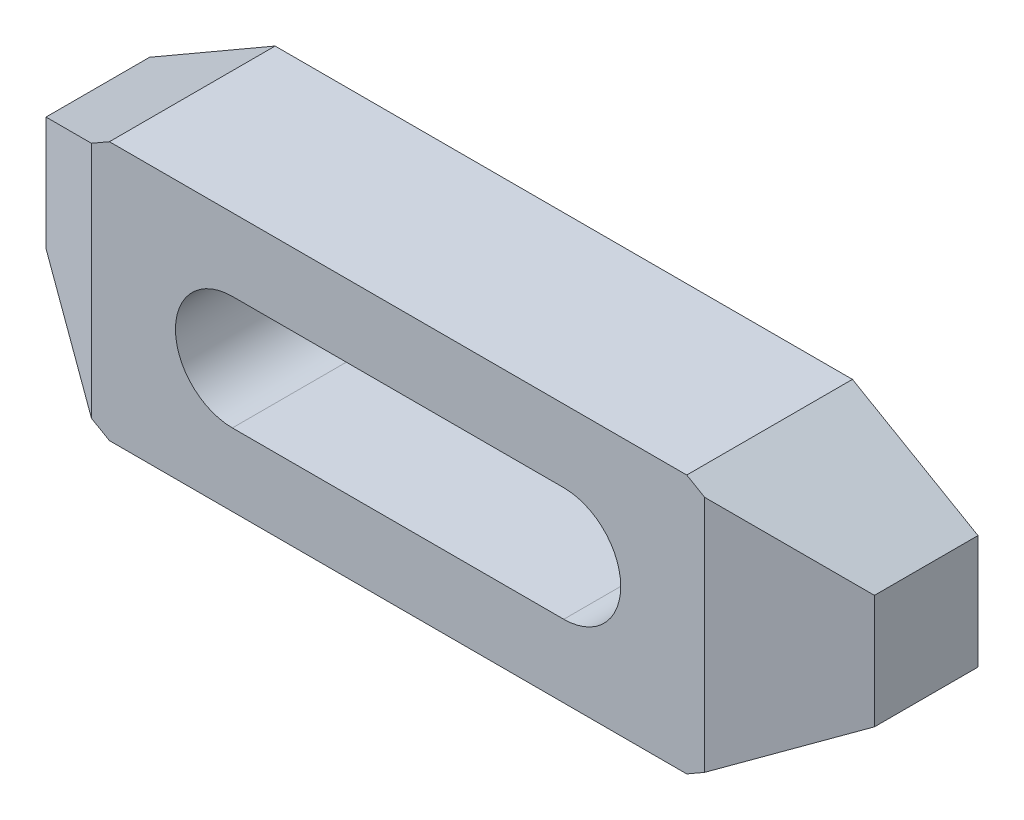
ISO-10303-21;
HEADER;
FILE_DESCRIPTION(('STEP AP214'),'2;1');
FILE_NAME('part.step','',(''),(''),'','','');
FILE_SCHEMA(('AUTOMOTIVE_DESIGN { 1 0 10303 214 1 1 1 1 }'));
ENDSEC;
DATA;
#1=APPLICATION_CONTEXT('core data for automotive mechanical design processes');
#2=APPLICATION_PROTOCOL_DEFINITION('international standard','automotive_design',2000,#1);
#3=PRODUCT_CONTEXT('',#1,'mechanical');
#4=PRODUCT('Part','Part','',(#3));
#5=PRODUCT_RELATED_PRODUCT_CATEGORY('part','',(#4));
#6=PRODUCT_DEFINITION_FORMATION('','',#4);
#7=PRODUCT_DEFINITION_CONTEXT('part definition',#1,'design');
#8=PRODUCT_DEFINITION('design','',#6,#7);
#9=PRODUCT_DEFINITION_SHAPE('','',#8);
#10=(LENGTH_UNIT() NAMED_UNIT(*) SI_UNIT(.MILLI.,.METRE.));
#11=(NAMED_UNIT(*) PLANE_ANGLE_UNIT() SI_UNIT($,.RADIAN.));
#12=(NAMED_UNIT(*) SI_UNIT($,.STERADIAN.) SOLID_ANGLE_UNIT());
#13=UNCERTAINTY_MEASURE_WITH_UNIT(LENGTH_MEASURE(1.E-05),#10,'distance_accuracy_value','');
#14=(GEOMETRIC_REPRESENTATION_CONTEXT(3) GLOBAL_UNCERTAINTY_ASSIGNED_CONTEXT((#13)) GLOBAL_UNIT_ASSIGNED_CONTEXT((#10,
#11,#12)) REPRESENTATION_CONTEXT('',''));
#15=CARTESIAN_POINT('',(0.,0.,0.));
#16=DIRECTION('',(0.,0.,1.));
#17=DIRECTION('',(1.,0.,0.));
#18=AXIS2_PLACEMENT_3D('',#15,#16,#17);
#19=CARTESIAN_POINT('',(0.,-28.5940107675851,16.));
#20=DIRECTION('',(0.,0.,-1.));
#21=DIRECTION('',(-1.,0.,0.));
#22=AXIS2_PLACEMENT_3D('',#19,#20,#21);
#23=PLANE('',#22);
#24=CARTESIAN_POINT('',(16.,0.,16.));
#25=DIRECTION('',(0.,0.,1.));
#26=DIRECTION('',(1.,0.,0.));
#27=AXIS2_PLACEMENT_3D('',#24,#25,#26);
#28=CIRCLE('',#27,5.5);
#29=CARTESIAN_POINT('',(16.,-5.5,16.));
#30=VERTEX_POINT('',#29);
#31=CARTESIAN_POINT('',(16.,5.5,16.));
#32=VERTEX_POINT('',#31);
#33=EDGE_CURVE('E221',#30,#32,#28,.T.);
#34=ORIENTED_EDGE('',*,*,#33,.F.);
#35=DIRECTION('',(-1.,0.,0.));
#36=VECTOR('',#35,1.);
#37=CARTESIAN_POINT('',(16.,-5.5,16.));
#38=LINE('',#37,#36);
#39=CARTESIAN_POINT('',(-16.,-5.5,16.));
#40=VERTEX_POINT('',#39);
#41=EDGE_CURVE('E220',#30,#40,#38,.T.);
#42=ORIENTED_EDGE('',*,*,#41,.T.);
#43=CARTESIAN_POINT('',(-16.,0.,16.));
#44=DIRECTION('',(0.,0.,1.));
#45=DIRECTION('',(1.,0.,0.));
#46=AXIS2_PLACEMENT_3D('',#43,#44,#45);
#47=CIRCLE('',#46,5.5);
#48=CARTESIAN_POINT('',(-16.,5.5,16.));
#49=VERTEX_POINT('',#48);
#50=EDGE_CURVE('E228',#49,#40,#47,.T.);
#51=ORIENTED_EDGE('',*,*,#50,.F.);
#52=DIRECTION('',(-1.,0.,0.));
#53=VECTOR('',#52,1.);
#54=CARTESIAN_POINT('',(16.,5.5,16.));
#55=LINE('',#54,#53);
#56=EDGE_CURVE('E224',#32,#49,#55,.T.);
#57=ORIENTED_EDGE('',*,*,#56,.F.);
#58=EDGE_LOOP('',(#34,#42,#51,#57));
#59=FACE_BOUND('',#58,.T.);
#60=DIRECTION('',(0.,1.,0.));
#61=VECTOR('',#60,1.);
#62=CARTESIAN_POINT('',(-29.6076951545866,-28.5940107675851,16.));
#63=LINE('',#62,#61);
#64=CARTESIAN_POINT('',(-29.6076951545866,-11.5,16.));
#65=VERTEX_POINT('',#64);
#66=CARTESIAN_POINT('',(-29.6076951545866,11.5,16.));
#67=VERTEX_POINT('',#66);
#68=EDGE_CURVE('E115',#65,#67,#63,.T.);
#69=ORIENTED_EDGE('',*,*,#68,.F.);
#70=DIRECTION('',(-0.866025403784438,0.5,0.));
#71=VECTOR('',#70,1.);
#72=CARTESIAN_POINT('',(-27.8756443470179,-12.5,16.));
#73=LINE('',#72,#71);
#74=CARTESIAN_POINT('',(-27.8756443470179,-12.5,16.));
#75=VERTEX_POINT('',#74);
#76=EDGE_CURVE('E174',#75,#65,#73,.T.);
#77=ORIENTED_EDGE('',*,*,#76,.F.);
#78=DIRECTION('',(-1.,0.,0.));
#79=VECTOR('',#78,1.);
#80=CARTESIAN_POINT('',(27.8756443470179,-12.5,16.));
#81=LINE('',#80,#79);
#82=CARTESIAN_POINT('',(27.8756443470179,-12.5,16.));
#83=VERTEX_POINT('',#82);
#84=EDGE_CURVE('E177',#83,#75,#81,.T.);
#85=ORIENTED_EDGE('',*,*,#84,.F.);
#86=DIRECTION('',(-0.866025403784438,-0.5,0.));
#87=VECTOR('',#86,1.);
#88=CARTESIAN_POINT('',(40.,-5.5,16.));
#89=LINE('',#88,#87);
#90=CARTESIAN_POINT('',(29.6076951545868,-11.5,16.));
#91=VERTEX_POINT('',#90);
#92=EDGE_CURVE('E157',#91,#83,#89,.T.);
#93=ORIENTED_EDGE('',*,*,#92,.F.);
#94=DIRECTION('',(0.,1.,0.));
#95=VECTOR('',#94,1.);
#96=CARTESIAN_POINT('',(29.6076951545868,-28.5940107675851,16.));
#97=LINE('',#96,#95);
#98=CARTESIAN_POINT('',(29.6076951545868,11.5,16.));
#99=VERTEX_POINT('',#98);
#100=EDGE_CURVE('E146',#91,#99,#97,.T.);
#101=ORIENTED_EDGE('',*,*,#100,.T.);
#102=DIRECTION('',(0.866025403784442,-0.5,0.));
#103=VECTOR('',#102,1.);
#104=CARTESIAN_POINT('',(27.8756443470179,12.5,16.));
#105=LINE('',#104,#103);
#106=CARTESIAN_POINT('',(27.8756443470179,12.5,16.));
#107=VERTEX_POINT('',#106);
#108=EDGE_CURVE('E155',#107,#99,#105,.T.);
#109=ORIENTED_EDGE('',*,*,#108,.F.);
#110=DIRECTION('',(1.,0.,0.));
#111=VECTOR('',#110,1.);
#112=CARTESIAN_POINT('',(-27.8756443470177,12.5,16.));
#113=LINE('',#112,#111);
#114=CARTESIAN_POINT('',(-27.8756443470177,12.5,16.));
#115=VERTEX_POINT('',#114);
#116=EDGE_CURVE('E164',#115,#107,#113,.T.);
#117=ORIENTED_EDGE('',*,*,#116,.F.);
#118=DIRECTION('',(0.866025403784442,0.5,0.));
#119=VECTOR('',#118,1.);
#120=CARTESIAN_POINT('',(-40.,5.5,16.));
#121=LINE('',#120,#119);
#122=EDGE_CURVE('E167',#67,#115,#121,.T.);
#123=ORIENTED_EDGE('',*,*,#122,.F.);
#124=EDGE_LOOP('',(#69,#77,#85,#93,#101,#109,#117,#123));
#125=FACE_BOUND('',#124,.T.);
#126=ADVANCED_FACE('F14',(#59,#125),#23,.F.);
#127=CARTESIAN_POINT('',(-40.,5.5,16.));
#128=DIRECTION('',(-0.5,0.866025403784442,0.));
#129=DIRECTION('',(-0.866025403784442,-0.5,0.));
#130=AXIS2_PLACEMENT_3D('',#127,#128,#129);
#131=PLANE('',#130);
#132=DIRECTION('',(0.,0.,-1.));
#133=VECTOR('',#132,1.);
#134=CARTESIAN_POINT('',(-40.,5.5,16.));
#135=LINE('',#134,#133);
#136=CARTESIAN_POINT('',(-40.,5.5,10.));
#137=VERTEX_POINT('',#136);
#138=CARTESIAN_POINT('',(-40.,5.5,0.));
#139=VERTEX_POINT('',#138);
#140=EDGE_CURVE('E124',#137,#139,#135,.T.);
#141=ORIENTED_EDGE('',*,*,#140,.F.);
#142=DIRECTION('',(0.774596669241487,0.447213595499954,0.447213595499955));
#143=VECTOR('',#142,1.);
#144=CARTESIAN_POINT('',(-37.9215390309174,6.7,11.2));
#145=LINE('',#144,#143);
#146=EDGE_CURVE('E112',#137,#67,#145,.T.);
#147=ORIENTED_EDGE('',*,*,#146,.T.);
#148=ORIENTED_EDGE('',*,*,#122,.T.);
#149=DIRECTION('',(0.,0.,-1.));
#150=VECTOR('',#149,1.);
#151=CARTESIAN_POINT('',(-27.8756443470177,12.5,16.));
#152=LINE('',#151,#150);
#153=CARTESIAN_POINT('',(-27.8756443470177,12.5,0.));
#154=VERTEX_POINT('',#153);
#155=EDGE_CURVE('E132',#115,#154,#152,.T.);
#156=ORIENTED_EDGE('',*,*,#155,.T.);
#157=DIRECTION('',(0.866025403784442,0.5,0.));
#158=VECTOR('',#157,1.);
#159=CARTESIAN_POINT('',(-40.,5.5,0.));
#160=LINE('',#159,#158);
#161=EDGE_CURVE('E131',#139,#154,#160,.T.);
#162=ORIENTED_EDGE('',*,*,#161,.F.);
#163=EDGE_LOOP('',(#141,#147,#148,#156,#162));
#164=FACE_BOUND('',#163,.T.);
#165=ADVANCED_FACE('F129',(#164),#131,.T.);
#166=CARTESIAN_POINT('',(-40.,-5.5,16.));
#167=DIRECTION('',(-1.,0.,0.));
#168=DIRECTION('',(0.,0.,1.));
#169=AXIS2_PLACEMENT_3D('',#166,#167,#168);
#170=PLANE('',#169);
#171=DIRECTION('',(0.,0.,-1.));
#172=VECTOR('',#171,1.);
#173=CARTESIAN_POINT('',(-40.,-5.5,16.));
#174=LINE('',#173,#172);
#175=CARTESIAN_POINT('',(-40.,-5.5,10.));
#176=VERTEX_POINT('',#175);
#177=CARTESIAN_POINT('',(-40.,-5.5,0.));
#178=VERTEX_POINT('',#177);
#179=EDGE_CURVE('E126',#176,#178,#174,.T.);
#180=ORIENTED_EDGE('',*,*,#179,.F.);
#181=DIRECTION('',(0.,1.,0.));
#182=VECTOR('',#181,1.);
#183=CARTESIAN_POINT('',(-40.,-13.,10.));
#184=LINE('',#183,#182);
#185=EDGE_CURVE('E29',#176,#137,#184,.T.);
#186=ORIENTED_EDGE('',*,*,#185,.T.);
#187=ORIENTED_EDGE('',*,*,#140,.T.);
#188=DIRECTION('',(0.,1.,0.));
#189=VECTOR('',#188,1.);
#190=CARTESIAN_POINT('',(-40.,-5.5,0.));
#191=LINE('',#190,#189);
#192=EDGE_CURVE('E199',#178,#139,#191,.T.);
#193=ORIENTED_EDGE('',*,*,#192,.F.);
#194=EDGE_LOOP('',(#180,#186,#187,#193));
#195=FACE_BOUND('',#194,.T.);
#196=ADVANCED_FACE('F122',(#195),#170,.T.);
#197=CARTESIAN_POINT('',(-27.8756443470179,-12.5,16.));
#198=DIRECTION('',(-0.5,-0.866025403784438,0.));
#199=DIRECTION('',(0.866025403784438,-0.5,0.));
#200=AXIS2_PLACEMENT_3D('',#197,#198,#199);
#201=PLANE('',#200);
#202=ORIENTED_EDGE('',*,*,#76,.T.);
#203=DIRECTION('',(-0.774596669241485,0.44721359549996,-0.447213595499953));
#204=VECTOR('',#203,1.);
#205=CARTESIAN_POINT('',(-28.2220545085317,-12.3,16.8));
#206=LINE('',#205,#204);
#207=EDGE_CURVE('E9',#65,#176,#206,.T.);
#208=ORIENTED_EDGE('',*,*,#207,.T.);
#209=ORIENTED_EDGE('',*,*,#179,.T.);
#210=DIRECTION('',(-0.866025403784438,0.5,0.));
#211=VECTOR('',#210,1.);
#212=CARTESIAN_POINT('',(-27.8756443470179,-12.5,0.));
#213=LINE('',#212,#211);
#214=CARTESIAN_POINT('',(-27.8756443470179,-12.5,0.));
#215=VERTEX_POINT('',#214);
#216=EDGE_CURVE('E195',#215,#178,#213,.T.);
#217=ORIENTED_EDGE('',*,*,#216,.F.);
#218=DIRECTION('',(0.,0.,-1.));
#219=VECTOR('',#218,1.);
#220=CARTESIAN_POINT('',(-27.8756443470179,-12.5,16.));
#221=LINE('',#220,#219);
#222=EDGE_CURVE('E136',#75,#215,#221,.T.);
#223=ORIENTED_EDGE('',*,*,#222,.F.);
#224=EDGE_LOOP('',(#202,#208,#209,#217,#223));
#225=FACE_BOUND('',#224,.T.);
#226=ADVANCED_FACE('F198',(#225),#201,.T.);
#227=CARTESIAN_POINT('',(0.,-28.5940107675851,0.));
#228=DIRECTION('',(0.,0.,-1.));
#229=DIRECTION('',(-1.,0.,0.));
#230=AXIS2_PLACEMENT_3D('',#227,#228,#229);
#231=PLANE('',#230);
#232=DIRECTION('',(-0.866025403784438,-0.5,0.));
#233=VECTOR('',#232,1.);
#234=CARTESIAN_POINT('',(40.,-5.5,0.));
#235=LINE('',#234,#233);
#236=CARTESIAN_POINT('',(40.,-5.5,0.));
#237=VERTEX_POINT('',#236);
#238=CARTESIAN_POINT('',(27.8756443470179,-12.5,0.));
#239=VERTEX_POINT('',#238);
#240=EDGE_CURVE('E170',#237,#239,#235,.T.);
#241=ORIENTED_EDGE('',*,*,#240,.T.);
#242=DIRECTION('',(-1.,0.,0.));
#243=VECTOR('',#242,1.);
#244=CARTESIAN_POINT('',(27.8756443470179,-12.5,0.));
#245=LINE('',#244,#243);
#246=EDGE_CURVE('E186',#239,#215,#245,.T.);
#247=ORIENTED_EDGE('',*,*,#246,.T.);
#248=ORIENTED_EDGE('',*,*,#216,.T.);
#249=ORIENTED_EDGE('',*,*,#192,.T.);
#250=ORIENTED_EDGE('',*,*,#161,.T.);
#251=DIRECTION('',(1.,0.,0.));
#252=VECTOR('',#251,1.);
#253=CARTESIAN_POINT('',(-27.8756443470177,12.5,0.));
#254=LINE('',#253,#252);
#255=CARTESIAN_POINT('',(27.8756443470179,12.5,0.));
#256=VERTEX_POINT('',#255);
#257=EDGE_CURVE('E204',#154,#256,#254,.T.);
#258=ORIENTED_EDGE('',*,*,#257,.T.);
#259=DIRECTION('',(0.866025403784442,-0.5,0.));
#260=VECTOR('',#259,1.);
#261=CARTESIAN_POINT('',(27.8756443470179,12.5,0.));
#262=LINE('',#261,#260);
#263=CARTESIAN_POINT('',(40.,5.50000000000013,0.));
#264=VERTEX_POINT('',#263);
#265=EDGE_CURVE('E207',#256,#264,#262,.T.);
#266=ORIENTED_EDGE('',*,*,#265,.T.);
#267=DIRECTION('',(0.,-1.,0.));
#268=VECTOR('',#267,1.);
#269=CARTESIAN_POINT('',(40.,5.50000000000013,0.));
#270=LINE('',#269,#268);
#271=EDGE_CURVE('E180',#264,#237,#270,.T.);
#272=ORIENTED_EDGE('',*,*,#271,.T.);
#273=EDGE_LOOP('',(#241,#247,#248,#249,#250,#258,#266,#272));
#274=FACE_BOUND('',#273,.T.);
#275=DIRECTION('',(-1.,0.,0.));
#276=VECTOR('',#275,1.);
#277=CARTESIAN_POINT('',(16.,-5.5,0.));
#278=LINE('',#277,#276);
#279=CARTESIAN_POINT('',(16.,-5.5,0.));
#280=VERTEX_POINT('',#279);
#281=CARTESIAN_POINT('',(-16.,-5.5,0.));
#282=VERTEX_POINT('',#281);
#283=EDGE_CURVE('E225',#280,#282,#278,.T.);
#284=ORIENTED_EDGE('',*,*,#283,.F.);
#285=CARTESIAN_POINT('',(16.,0.,0.));
#286=DIRECTION('',(0.,0.,1.));
#287=DIRECTION('',(1.,0.,0.));
#288=AXIS2_PLACEMENT_3D('',#285,#286,#287);
#289=CIRCLE('',#288,5.5);
#290=CARTESIAN_POINT('',(16.,5.5,0.));
#291=VERTEX_POINT('',#290);
#292=EDGE_CURVE('E232',#280,#291,#289,.T.);
#293=ORIENTED_EDGE('',*,*,#292,.T.);
#294=DIRECTION('',(-1.,0.,0.));
#295=VECTOR('',#294,1.);
#296=CARTESIAN_POINT('',(16.,5.5,0.));
#297=LINE('',#296,#295);
#298=CARTESIAN_POINT('',(-16.,5.5,0.));
#299=VERTEX_POINT('',#298);
#300=EDGE_CURVE('E235',#291,#299,#297,.T.);
#301=ORIENTED_EDGE('',*,*,#300,.T.);
#302=CARTESIAN_POINT('',(-16.,0.,0.));
#303=DIRECTION('',(0.,0.,1.));
#304=DIRECTION('',(1.,0.,0.));
#305=AXIS2_PLACEMENT_3D('',#302,#303,#304);
#306=CIRCLE('',#305,5.5);
#307=EDGE_CURVE('E238',#299,#282,#306,.T.);
#308=ORIENTED_EDGE('',*,*,#307,.T.);
#309=EDGE_LOOP('',(#284,#293,#301,#308));
#310=FACE_BOUND('',#309,.T.);
#311=ADVANCED_FACE('F193',(#274,#310),#231,.T.);
#312=CARTESIAN_POINT('',(40.,-5.5,16.));
#313=DIRECTION('',(0.5,-0.866025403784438,0.));
#314=DIRECTION('',(0.866025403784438,0.5,0.));
#315=AXIS2_PLACEMENT_3D('',#312,#313,#314);
#316=PLANE('',#315);
#317=DIRECTION('',(0.774596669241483,0.447213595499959,-0.447213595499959));
#318=VECTOR('',#317,1.);
#319=CARTESIAN_POINT('',(37.9215390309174,-6.7,11.2));
#320=LINE('',#319,#318);
#321=CARTESIAN_POINT('',(40.,-5.5,10.));
#322=VERTEX_POINT('',#321);
#323=EDGE_CURVE('E158',#91,#322,#320,.T.);
#324=ORIENTED_EDGE('',*,*,#323,.F.);
#325=ORIENTED_EDGE('',*,*,#92,.T.);
#326=DIRECTION('',(0.,0.,-1.));
#327=VECTOR('',#326,1.);
#328=CARTESIAN_POINT('',(27.8756443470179,-12.5,16.));
#329=LINE('',#328,#327);
#330=EDGE_CURVE('E163',#83,#239,#329,.T.);
#331=ORIENTED_EDGE('',*,*,#330,.T.);
#332=ORIENTED_EDGE('',*,*,#240,.F.);
#333=DIRECTION('',(0.,0.,-1.));
#334=VECTOR('',#333,1.);
#335=CARTESIAN_POINT('',(40.,-5.5,16.));
#336=LINE('',#335,#334);
#337=EDGE_CURVE('E143',#322,#237,#336,.T.);
#338=ORIENTED_EDGE('',*,*,#337,.F.);
#339=EDGE_LOOP('',(#324,#325,#331,#332,#338));
#340=FACE_BOUND('',#339,.T.);
#341=ADVANCED_FACE('F249',(#340),#316,.T.);
#342=CARTESIAN_POINT('',(40.,5.50000000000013,16.));
#343=DIRECTION('',(1.,0.,0.));
#344=DIRECTION('',(0.,0.,-1.));
#345=AXIS2_PLACEMENT_3D('',#342,#343,#344);
#346=PLANE('',#345);
#347=DIRECTION('',(0.,1.,0.));
#348=VECTOR('',#347,1.);
#349=CARTESIAN_POINT('',(40.,-13.,10.));
#350=LINE('',#349,#348);
#351=CARTESIAN_POINT('',(40.,5.50000000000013,10.));
#352=VERTEX_POINT('',#351);
#353=EDGE_CURVE('E36',#322,#352,#350,.T.);
#354=ORIENTED_EDGE('',*,*,#353,.F.);
#355=ORIENTED_EDGE('',*,*,#337,.T.);
#356=ORIENTED_EDGE('',*,*,#271,.F.);
#357=DIRECTION('',(0.,0.,-1.));
#358=VECTOR('',#357,1.);
#359=CARTESIAN_POINT('',(40.,5.50000000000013,16.));
#360=LINE('',#359,#358);
#361=EDGE_CURVE('E141',#352,#264,#360,.T.);
#362=ORIENTED_EDGE('',*,*,#361,.F.);
#363=EDGE_LOOP('',(#354,#355,#356,#362));
#364=FACE_BOUND('',#363,.T.);
#365=ADVANCED_FACE('F16',(#364),#346,.T.);
#366=CARTESIAN_POINT('',(27.8756443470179,12.5,16.));
#367=DIRECTION('',(0.5,0.866025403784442,0.));
#368=DIRECTION('',(-0.866025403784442,0.5,0.));
#369=AXIS2_PLACEMENT_3D('',#366,#367,#368);
#370=PLANE('',#369);
#371=DIRECTION('',(-0.774596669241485,0.447213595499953,0.44721359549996));
#372=VECTOR('',#371,1.);
#373=CARTESIAN_POINT('',(28.2220545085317,12.3,16.8));
#374=LINE('',#373,#372);
#375=EDGE_CURVE('E22',#352,#99,#374,.T.);
#376=ORIENTED_EDGE('',*,*,#375,.F.);
#377=ORIENTED_EDGE('',*,*,#361,.T.);
#378=ORIENTED_EDGE('',*,*,#265,.F.);
#379=DIRECTION('',(0.,0.,-1.));
#380=VECTOR('',#379,1.);
#381=CARTESIAN_POINT('',(27.8756443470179,12.5,16.));
#382=LINE('',#381,#380);
#383=EDGE_CURVE('E134',#107,#256,#382,.T.);
#384=ORIENTED_EDGE('',*,*,#383,.F.);
#385=ORIENTED_EDGE('',*,*,#108,.T.);
#386=EDGE_LOOP('',(#376,#377,#378,#384,#385));
#387=FACE_BOUND('',#386,.T.);
#388=ADVANCED_FACE('F160',(#387),#370,.T.);
#389=CARTESIAN_POINT('',(-27.8756443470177,12.5,16.));
#390=DIRECTION('',(0.,1.,0.));
#391=DIRECTION('',(-1.,0.,0.));
#392=AXIS2_PLACEMENT_3D('',#389,#390,#391);
#393=PLANE('',#392);
#394=ORIENTED_EDGE('',*,*,#155,.F.);
#395=ORIENTED_EDGE('',*,*,#116,.T.);
#396=ORIENTED_EDGE('',*,*,#383,.T.);
#397=ORIENTED_EDGE('',*,*,#257,.F.);
#398=EDGE_LOOP('',(#394,#395,#396,#397));
#399=FACE_BOUND('',#398,.T.);
#400=ADVANCED_FACE('F253',(#399),#393,.T.);
#401=CARTESIAN_POINT('',(27.8756443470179,-12.5,16.));
#402=DIRECTION('',(0.,-1.,0.));
#403=DIRECTION('',(1.,0.,0.));
#404=AXIS2_PLACEMENT_3D('',#401,#402,#403);
#405=PLANE('',#404);
#406=ORIENTED_EDGE('',*,*,#84,.T.);
#407=ORIENTED_EDGE('',*,*,#222,.T.);
#408=ORIENTED_EDGE('',*,*,#246,.F.);
#409=ORIENTED_EDGE('',*,*,#330,.F.);
#410=EDGE_LOOP('',(#406,#407,#408,#409));
#411=FACE_BOUND('',#410,.T.);
#412=ADVANCED_FACE('F184',(#411),#405,.T.);
#413=CARTESIAN_POINT('',(16.,0.,16.));
#414=DIRECTION('',(0.,0.,-1.));
#415=DIRECTION('',(-1.,0.,0.));
#416=AXIS2_PLACEMENT_3D('',#413,#414,#415);
#417=CYLINDRICAL_SURFACE('',#416,5.5);
#418=DIRECTION('',(0.,0.,-1.));
#419=VECTOR('',#418,1.);
#420=CARTESIAN_POINT('',(16.,5.5,16.));
#421=LINE('',#420,#419);
#422=EDGE_CURVE('E211',#32,#291,#421,.T.);
#423=ORIENTED_EDGE('',*,*,#422,.T.);
#424=ORIENTED_EDGE('',*,*,#292,.F.);
#425=DIRECTION('',(0.,0.,-1.));
#426=VECTOR('',#425,1.);
#427=CARTESIAN_POINT('',(16.,-5.5,16.));
#428=LINE('',#427,#426);
#429=EDGE_CURVE('E217',#30,#280,#428,.T.);
#430=ORIENTED_EDGE('',*,*,#429,.F.);
#431=ORIENTED_EDGE('',*,*,#33,.T.);
#432=EDGE_LOOP('',(#423,#424,#430,#431));
#433=FACE_BOUND('',#432,.T.);
#434=ADVANCED_FACE('F261',(#433),#417,.F.);
#435=CARTESIAN_POINT('',(16.,5.5,16.));
#436=DIRECTION('',(0.,-1.,0.));
#437=DIRECTION('',(1.,0.,0.));
#438=AXIS2_PLACEMENT_3D('',#435,#436,#437);
#439=PLANE('',#438);
#440=DIRECTION('',(0.,0.,-1.));
#441=VECTOR('',#440,1.);
#442=CARTESIAN_POINT('',(-16.,5.5,16.));
#443=LINE('',#442,#441);
#444=EDGE_CURVE('E213',#49,#299,#443,.T.);
#445=ORIENTED_EDGE('',*,*,#444,.T.);
#446=ORIENTED_EDGE('',*,*,#300,.F.);
#447=ORIENTED_EDGE('',*,*,#422,.F.);
#448=ORIENTED_EDGE('',*,*,#56,.T.);
#449=EDGE_LOOP('',(#445,#446,#447,#448));
#450=FACE_BOUND('',#449,.T.);
#451=ADVANCED_FACE('F336',(#450),#439,.T.);
#452=CARTESIAN_POINT('',(-16.,0.,16.));
#453=DIRECTION('',(0.,0.,-1.));
#454=DIRECTION('',(-1.,0.,0.));
#455=AXIS2_PLACEMENT_3D('',#452,#453,#454);
#456=CYLINDRICAL_SURFACE('',#455,5.5);
#457=DIRECTION('',(0.,0.,-1.));
#458=VECTOR('',#457,1.);
#459=CARTESIAN_POINT('',(-16.,-5.5,16.));
#460=LINE('',#459,#458);
#461=EDGE_CURVE('E215',#40,#282,#460,.T.);
#462=ORIENTED_EDGE('',*,*,#461,.T.);
#463=ORIENTED_EDGE('',*,*,#307,.F.);
#464=ORIENTED_EDGE('',*,*,#444,.F.);
#465=ORIENTED_EDGE('',*,*,#50,.T.);
#466=EDGE_LOOP('',(#462,#463,#464,#465));
#467=FACE_BOUND('',#466,.T.);
#468=ADVANCED_FACE('F346',(#467),#456,.F.);
#469=CARTESIAN_POINT('',(16.,-5.5,16.));
#470=DIRECTION('',(0.,-1.,0.));
#471=DIRECTION('',(1.,0.,0.));
#472=AXIS2_PLACEMENT_3D('',#469,#470,#471);
#473=PLANE('',#472);
#474=ORIENTED_EDGE('',*,*,#41,.F.);
#475=ORIENTED_EDGE('',*,*,#429,.T.);
#476=ORIENTED_EDGE('',*,*,#283,.T.);
#477=ORIENTED_EDGE('',*,*,#461,.F.);
#478=EDGE_LOOP('',(#474,#475,#476,#477));
#479=FACE_BOUND('',#478,.T.);
#480=ADVANCED_FACE('F355',(#479),#473,.F.);
#481=CARTESIAN_POINT('',(40.,-13.,10.));
#482=DIRECTION('',(-0.5,0.,-0.866025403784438));
#483=DIRECTION('',(-0.866025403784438,0.,0.5));
#484=AXIS2_PLACEMENT_3D('',#481,#482,#483);
#485=PLANE('',#484);
#486=ORIENTED_EDGE('',*,*,#323,.T.);
#487=ORIENTED_EDGE('',*,*,#353,.T.);
#488=ORIENTED_EDGE('',*,*,#375,.T.);
#489=ORIENTED_EDGE('',*,*,#100,.F.);
#490=EDGE_LOOP('',(#486,#487,#488,#489));
#491=FACE_BOUND('',#490,.T.);
#492=ADVANCED_FACE('F145',(#491),#485,.F.);
#493=CARTESIAN_POINT('',(-40.,-13.,10.));
#494=DIRECTION('',(-0.5,0.,0.866025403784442));
#495=DIRECTION('',(0.866025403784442,0.,0.5));
#496=AXIS2_PLACEMENT_3D('',#493,#494,#495);
#497=PLANE('',#496);
#498=ORIENTED_EDGE('',*,*,#185,.F.);
#499=ORIENTED_EDGE('',*,*,#207,.F.);
#500=ORIENTED_EDGE('',*,*,#68,.T.);
#501=ORIENTED_EDGE('',*,*,#146,.F.);
#502=EDGE_LOOP('',(#498,#499,#500,#501));
#503=FACE_BOUND('',#502,.T.);
#504=ADVANCED_FACE('F113',(#503),#497,.T.);
#505=CLOSED_SHELL('',(#126,#165,#196,#226,#311,#341,#365,#388,#400,#412,#434,#451,#468,#480,
#492,#504));
#506=MANIFOLD_SOLID_BREP('B1',#505);
#507=ADVANCED_BREP_SHAPE_REPRESENTATION('',(#18,#506),#14);
#508=SHAPE_DEFINITION_REPRESENTATION(#9,#507);
ENDSEC;
END-ISO-10303-21;
